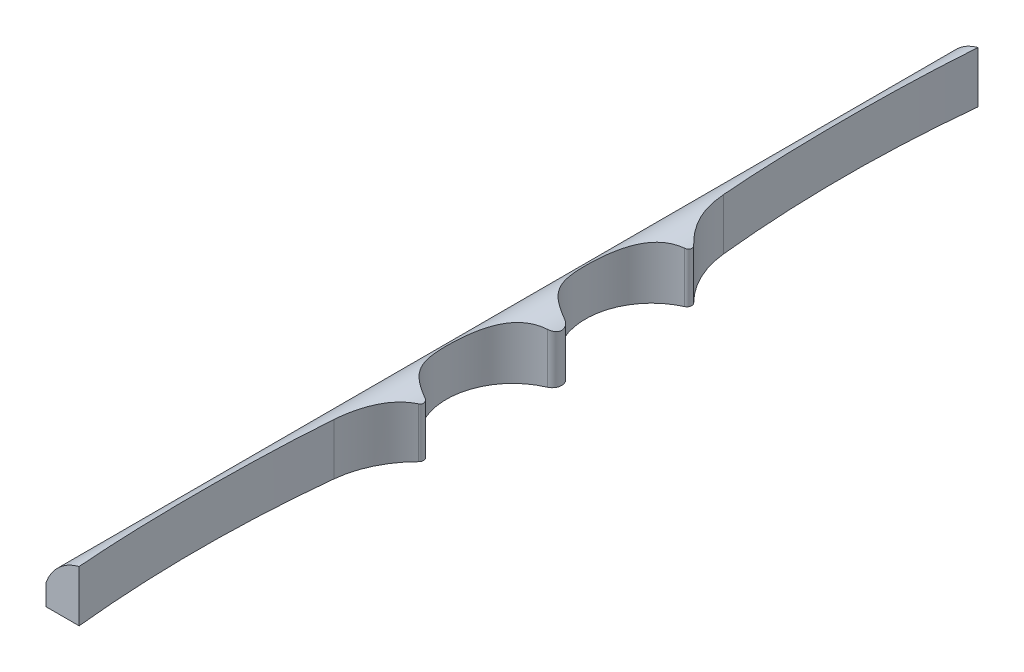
ISO-10303-21;
HEADER;
FILE_DESCRIPTION(('STEP AP214'),'2;1');
FILE_NAME('part.step','',(''),(''),'','','');
FILE_SCHEMA(('AUTOMOTIVE_DESIGN { 1 0 10303 214 1 1 1 1 }'));
ENDSEC;
DATA;
#1=APPLICATION_CONTEXT('core data for automotive mechanical design processes');
#2=APPLICATION_PROTOCOL_DEFINITION('international standard','automotive_design',2000,#1);
#3=PRODUCT_CONTEXT('',#1,'mechanical');
#4=PRODUCT('Part','Part','',(#3));
#5=PRODUCT_RELATED_PRODUCT_CATEGORY('part','',(#4));
#6=PRODUCT_DEFINITION_FORMATION('','',#4);
#7=PRODUCT_DEFINITION_CONTEXT('part definition',#1,'design');
#8=PRODUCT_DEFINITION('design','',#6,#7);
#9=PRODUCT_DEFINITION_SHAPE('','',#8);
#10=(LENGTH_UNIT() NAMED_UNIT(*) SI_UNIT(.MILLI.,.METRE.));
#11=(NAMED_UNIT(*) PLANE_ANGLE_UNIT() SI_UNIT($,.RADIAN.));
#12=(NAMED_UNIT(*) SI_UNIT($,.STERADIAN.) SOLID_ANGLE_UNIT());
#13=UNCERTAINTY_MEASURE_WITH_UNIT(LENGTH_MEASURE(1.E-05),#10,'distance_accuracy_value','');
#14=(GEOMETRIC_REPRESENTATION_CONTEXT(3) GLOBAL_UNCERTAINTY_ASSIGNED_CONTEXT((#13)) GLOBAL_UNIT_ASSIGNED_CONTEXT((#10,
#11,#12)) REPRESENTATION_CONTEXT('',''));
#15=CARTESIAN_POINT('',(0.,0.,0.));
#16=DIRECTION('',(0.,0.,1.));
#17=DIRECTION('',(1.,0.,0.));
#18=AXIS2_PLACEMENT_3D('',#15,#16,#17);
#19=CARTESIAN_POINT('',(-40.,35.,490.));
#20=DIRECTION('',(1.,0.,0.));
#21=DIRECTION('',(0.,1.,0.));
#22=AXIS2_PLACEMENT_3D('',#19,#20,#21);
#23=PLANE('',#22);
#24=DIRECTION('',(0.,1.,0.));
#25=VECTOR('',#24,1.);
#26=CARTESIAN_POINT('',(-40.,-35.,475.));
#27=LINE('',#26,#25);
#28=CARTESIAN_POINT('',(-40.,-35.,475.));
#29=VERTEX_POINT('',#28);
#30=CARTESIAN_POINT('',(-40.0000000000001,-12.9999999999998,475.));
#31=VERTEX_POINT('',#30);
#32=EDGE_CURVE('E141',#29,#31,#27,.T.);
#33=ORIENTED_EDGE('',*,*,#32,.T.);
#34=DIRECTION('',(0.,0.,-1.));
#35=VECTOR('',#34,1.);
#36=CARTESIAN_POINT('',(-40.0000000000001,-12.9999999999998,475.));
#37=LINE('',#36,#35);
#38=CARTESIAN_POINT('',(-40.0000000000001,-12.9999999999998,-475.));
#39=VERTEX_POINT('',#38);
#40=EDGE_CURVE('E124',#31,#39,#37,.T.);
#41=ORIENTED_EDGE('',*,*,#40,.T.);
#42=DIRECTION('',(0.,1.,0.));
#43=VECTOR('',#42,1.);
#44=CARTESIAN_POINT('',(-40.,-35.,-475.));
#45=LINE('',#44,#43);
#46=CARTESIAN_POINT('',(-40.,-35.,-475.));
#47=VERTEX_POINT('',#46);
#48=EDGE_CURVE('E147',#47,#39,#45,.T.);
#49=ORIENTED_EDGE('',*,*,#48,.F.);
#50=DIRECTION('',(0.,0.,-1.));
#51=VECTOR('',#50,1.);
#52=CARTESIAN_POINT('',(-40.,-35.,490.));
#53=LINE('',#52,#51);
#54=EDGE_CURVE('E46',#29,#47,#53,.T.);
#55=ORIENTED_EDGE('',*,*,#54,.F.);
#56=EDGE_LOOP('',(#33,#41,#49,#55));
#57=FACE_BOUND('',#56,.T.);
#58=ADVANCED_FACE('F34',(#57),#23,.F.);
#59=CARTESIAN_POINT('',(-40.,-35.,490.));
#60=DIRECTION('',(0.,1.,0.));
#61=DIRECTION('',(0.,0.,1.));
#62=AXIS2_PLACEMENT_3D('',#59,#60,#61);
#63=PLANE('',#62);
#64=DIRECTION('',(1.,0.,0.));
#65=VECTOR('',#64,1.);
#66=CARTESIAN_POINT('',(-40.,-35.,-475.));
#67=LINE('',#66,#65);
#68=CARTESIAN_POINT('',(-5.00000000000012,-35.,-475.));
#69=VERTEX_POINT('',#68);
#70=EDGE_CURVE('E144',#47,#69,#67,.T.);
#71=ORIENTED_EDGE('',*,*,#70,.T.);
#72=CARTESIAN_POINT('',(1290.30701747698,-35.,-341.220593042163));
#73=DIRECTION('',(0.,1.,0.));
#74=DIRECTION('',(0.,0.,-1.));
#75=AXIS2_PLACEMENT_3D('',#72,#73,#74);
#76=CIRCLE('',#75,1302.19706621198);
#77=CARTESIAN_POINT('',(-4.84315200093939,-35.,-205.93113390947));
#78=VERTEX_POINT('',#77);
#79=EDGE_CURVE('E160',#69,#78,#76,.T.);
#80=ORIENTED_EDGE('',*,*,#79,.T.);
#81=CARTESIAN_POINT('',(94.6156935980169,-35.,-216.320456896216));
#82=DIRECTION('',(0.,1.,0.));
#83=DIRECTION('',(0.,0.,1.));
#84=AXIS2_PLACEMENT_3D('',#81,#82,#83);
#85=CIRCLE('',#84,99.9999999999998);
#86=CARTESIAN_POINT('',(24.2222778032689,-35.,-145.293933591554));
#87=VERTEX_POINT('',#86);
#88=EDGE_CURVE('E163',#78,#87,#85,.T.);
#89=ORIENTED_EDGE('',*,*,#88,.T.);
#90=CARTESIAN_POINT('',(20.7026070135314,-35.,-141.742607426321));
#91=DIRECTION('',(0.,-1.,0.));
#92=DIRECTION('',(0.,0.,-1.));
#93=AXIS2_PLACEMENT_3D('',#90,#91,#92);
#94=CIRCLE('',#93,5.00000000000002);
#95=CARTESIAN_POINT('',(22.7693613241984,-35.,-137.189748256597));
#96=VERTEX_POINT('',#95);
#97=EDGE_CURVE('E167',#87,#96,#94,.T.);
#98=ORIENTED_EDGE('',*,*,#97,.T.);
#99=CARTESIAN_POINT('',(51.703921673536,-35.,-73.4497198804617));
#100=DIRECTION('',(0.,1.,0.));
#101=DIRECTION('',(0.,0.,1.));
#102=AXIS2_PLACEMENT_3D('',#99,#100,#101);
#103=CIRCLE('',#102,70.);
#104=CARTESIAN_POINT('',(23.962990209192,-35.,-9.18121498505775));
#105=VERTEX_POINT('',#104);
#106=EDGE_CURVE('E178',#96,#105,#103,.T.);
#107=ORIENTED_EDGE('',*,*,#106,.T.);
#108=CARTESIAN_POINT('',(20.,-35.,0.));
#109=DIRECTION('',(0.,-1.,0.));
#110=DIRECTION('',(0.,0.,1.));
#111=AXIS2_PLACEMENT_3D('',#108,#109,#110);
#112=CIRCLE('',#111,10.);
#113=CARTESIAN_POINT('',(23.962990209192,-35.,9.18121498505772));
#114=VERTEX_POINT('',#113);
#115=EDGE_CURVE('E181',#105,#114,#112,.T.);
#116=ORIENTED_EDGE('',*,*,#115,.T.);
#117=CARTESIAN_POINT('',(51.703921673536,-35.,73.4497198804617));
#118=DIRECTION('',(0.,1.,0.));
#119=DIRECTION('',(0.,0.,-1.));
#120=AXIS2_PLACEMENT_3D('',#117,#118,#119);
#121=CIRCLE('',#120,70.);
#122=CARTESIAN_POINT('',(22.7693613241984,-35.,137.189748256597));
#123=VERTEX_POINT('',#122);
#124=EDGE_CURVE('E184',#114,#123,#121,.T.);
#125=ORIENTED_EDGE('',*,*,#124,.T.);
#126=CARTESIAN_POINT('',(20.7026070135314,-35.,141.742607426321));
#127=DIRECTION('',(0.,-1.,0.));
#128=DIRECTION('',(0.,0.,-1.));
#129=AXIS2_PLACEMENT_3D('',#126,#127,#128);
#130=CIRCLE('',#129,5.00000000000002);
#131=CARTESIAN_POINT('',(24.2222778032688,-35.,145.293933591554));
#132=VERTEX_POINT('',#131);
#133=EDGE_CURVE('E187',#123,#132,#130,.T.);
#134=ORIENTED_EDGE('',*,*,#133,.T.);
#135=CARTESIAN_POINT('',(94.6156935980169,-35.,216.320456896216));
#136=DIRECTION('',(0.,1.,0.));
#137=DIRECTION('',(0.,0.,-1.));
#138=AXIS2_PLACEMENT_3D('',#135,#136,#137);
#139=CIRCLE('',#138,99.9999999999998);
#140=CARTESIAN_POINT('',(-4.84315200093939,-35.,205.93113390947));
#141=VERTEX_POINT('',#140);
#142=EDGE_CURVE('E190',#132,#141,#139,.T.);
#143=ORIENTED_EDGE('',*,*,#142,.T.);
#144=CARTESIAN_POINT('',(1290.30701747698,-35.,341.220593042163));
#145=DIRECTION('',(0.,1.,0.));
#146=DIRECTION('',(0.,0.,1.));
#147=AXIS2_PLACEMENT_3D('',#144,#145,#146);
#148=CIRCLE('',#147,1302.19706621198);
#149=CARTESIAN_POINT('',(-4.99999999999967,-35.,475.));
#150=VERTEX_POINT('',#149);
#151=EDGE_CURVE('E193',#141,#150,#148,.T.);
#152=ORIENTED_EDGE('',*,*,#151,.T.);
#153=DIRECTION('',(-1.,0.,0.));
#154=VECTOR('',#153,1.);
#155=CARTESIAN_POINT('',(-40.,-35.,475.));
#156=LINE('',#155,#154);
#157=EDGE_CURVE('E145',#150,#29,#156,.T.);
#158=ORIENTED_EDGE('',*,*,#157,.T.);
#159=ORIENTED_EDGE('',*,*,#54,.T.);
#160=EDGE_LOOP('',(#71,#80,#89,#98,#107,#116,#125,#134,#143,#152,#158,#159));
#161=FACE_BOUND('',#160,.T.);
#162=ADVANCED_FACE('F158',(#161),#63,.F.);
#163=CARTESIAN_POINT('',(-40.,-35.,-475.));
#164=DIRECTION('',(0.,0.,1.));
#165=DIRECTION('',(1.,0.,0.));
#166=AXIS2_PLACEMENT_3D('',#163,#164,#165);
#167=PLANE('',#166);
#168=ORIENTED_EDGE('',*,*,#48,.T.);
#169=CARTESIAN_POINT('',(7.34260642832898,-29.0834578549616,-475.));
#170=DIRECTION('',(0.,0.,1.));
#171=DIRECTION('',(-1.,0.,0.));
#172=AXIS2_PLACEMENT_3D('',#169,#170,#171);
#173=CIRCLE('',#172,50.);
#174=CARTESIAN_POINT('',(-4.99999999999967,19.3692001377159,-475.));
#175=VERTEX_POINT('',#174);
#176=EDGE_CURVE('E130',#175,#39,#173,.T.);
#177=ORIENTED_EDGE('',*,*,#176,.F.);
#178=DIRECTION('',(0.,1.,0.));
#179=VECTOR('',#178,1.);
#180=CARTESIAN_POINT('',(-5.00000000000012,-35.,-475.));
#181=LINE('',#180,#179);
#182=EDGE_CURVE('E149',#69,#175,#181,.T.);
#183=ORIENTED_EDGE('',*,*,#182,.F.);
#184=ORIENTED_EDGE('',*,*,#70,.F.);
#185=EDGE_LOOP('',(#168,#177,#183,#184));
#186=FACE_BOUND('',#185,.T.);
#187=ADVANCED_FACE('F154',(#186),#167,.F.);
#188=CARTESIAN_POINT('',(-40.,-35.,475.));
#189=DIRECTION('',(0.,0.,-1.));
#190=DIRECTION('',(-1.,0.,0.));
#191=AXIS2_PLACEMENT_3D('',#188,#189,#190);
#192=PLANE('',#191);
#193=DIRECTION('',(0.,1.,0.));
#194=VECTOR('',#193,1.);
#195=CARTESIAN_POINT('',(-4.99999999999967,-35.,475.));
#196=LINE('',#195,#194);
#197=CARTESIAN_POINT('',(-4.99999999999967,19.3692001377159,475.));
#198=VERTEX_POINT('',#197);
#199=EDGE_CURVE('E142',#150,#198,#196,.T.);
#200=ORIENTED_EDGE('',*,*,#199,.T.);
#201=CARTESIAN_POINT('',(7.34260642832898,-29.0834578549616,475.));
#202=DIRECTION('',(0.,0.,1.));
#203=DIRECTION('',(-1.,0.,0.));
#204=AXIS2_PLACEMENT_3D('',#201,#202,#203);
#205=CIRCLE('',#204,50.);
#206=EDGE_CURVE('E127',#198,#31,#205,.T.);
#207=ORIENTED_EDGE('',*,*,#206,.T.);
#208=ORIENTED_EDGE('',*,*,#32,.F.);
#209=ORIENTED_EDGE('',*,*,#157,.F.);
#210=EDGE_LOOP('',(#200,#207,#208,#209));
#211=FACE_BOUND('',#210,.T.);
#212=ADVANCED_FACE('F139',(#211),#192,.F.);
#213=CARTESIAN_POINT('',(1290.30701747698,-35.,-341.220593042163));
#214=DIRECTION('',(0.,1.,0.));
#215=DIRECTION('',(0.,0.,1.));
#216=AXIS2_PLACEMENT_3D('',#213,#214,#215);
#217=CYLINDRICAL_SURFACE('',#216,1302.19706621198);
#218=ORIENTED_EDGE('',*,*,#182,.T.);
#219=CARTESIAN_POINT('',(-4.99999999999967,19.369200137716,-475.));
#220=CARTESIAN_POINT('',(-5.42881179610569,19.2599278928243,-470.848069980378));
#221=CARTESIAN_POINT('',(-5.83765826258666,19.1497553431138,-466.694101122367));
#222=CARTESIAN_POINT('',(-6.61539129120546,18.9304832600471,-458.382392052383));
#223=CARTESIAN_POINT('',(-6.98427781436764,18.8213837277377,-454.224651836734));
#224=CARTESIAN_POINT('',(-7.68206251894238,18.6071310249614,-445.905694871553));
#225=CARTESIAN_POINT('',(-8.01096051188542,18.5019778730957,-441.744478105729));
#226=CARTESIAN_POINT('',(-8.62873659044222,18.2982060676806,-433.418913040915));
#227=CARTESIAN_POINT('',(-8.91761466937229,18.1995874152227,-429.254564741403));
#228=CARTESIAN_POINT('',(-9.45472845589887,18.0114497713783,-420.932272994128));
#229=CARTESIAN_POINT('',(-9.70305243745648,17.9219111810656,-416.774335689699));
#230=CARTESIAN_POINT('',(-10.1597996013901,17.753760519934,-408.456055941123));
#231=CARTESIAN_POINT('',(-10.3682228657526,17.6751484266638,-404.295713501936));
#232=CARTESIAN_POINT('',(-10.7451454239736,17.5306384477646,-395.972957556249));
#233=CARTESIAN_POINT('',(-10.9136443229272,17.4647406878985,-391.810544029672));
#234=CARTESIAN_POINT('',(-11.2106942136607,17.3471418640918,-383.484054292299));
#235=CARTESIAN_POINT('',(-11.3392448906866,17.295440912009,-379.319978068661));
#236=CARTESIAN_POINT('',(-11.5396528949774,17.214166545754,-371.632214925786));
#237=CARTESIAN_POINT('',(-11.6171932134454,17.18241129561,-368.108697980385));
#238=CARTESIAN_POINT('',(-11.7436638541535,17.1303819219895,-361.061052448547));
#239=CARTESIAN_POINT('',(-11.7925940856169,17.1101078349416,-357.536923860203));
#240=CARTESIAN_POINT('',(-11.8618390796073,17.0813628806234,-350.488299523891));
#241=CARTESIAN_POINT('',(-11.8821535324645,17.0728921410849,-346.963803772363));
#242=CARTESIAN_POINT('',(-11.8941637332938,17.0678879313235,-339.91475419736));
#243=CARTESIAN_POINT('',(-11.8858594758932,17.0713544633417,-336.390200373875));
#244=CARTESIAN_POINT('',(-11.840631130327,17.0901709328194,-329.340990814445));
#245=CARTESIAN_POINT('',(-11.8037044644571,17.1055219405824,-325.816335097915));
#246=CARTESIAN_POINT('',(-11.7012322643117,17.1478657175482,-318.767509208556));
#247=CARTESIAN_POINT('',(-11.6356867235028,17.1748584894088,-315.24333903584));
#248=CARTESIAN_POINT('',(-11.4759842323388,17.2400575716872,-308.195767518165));
#249=CARTESIAN_POINT('',(-11.3818274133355,17.2782638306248,-304.67236616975));
#250=CARTESIAN_POINT('',(-11.1649120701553,17.3652817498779,-297.626574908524));
#251=CARTESIAN_POINT('',(-11.0421535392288,17.4140934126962,-294.104184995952));
#252=CARTESIAN_POINT('',(-10.7675364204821,17.5217409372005,-287.047548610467));
#253=CARTESIAN_POINT('',(-10.615571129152,17.5806134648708,-283.513306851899));
#254=CARTESIAN_POINT('',(-10.2828519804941,17.7072986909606,-276.446339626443));
#255=CARTESIAN_POINT('',(-10.1020981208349,17.7751113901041,-272.913614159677));
#256=CARTESIAN_POINT('',(-9.71181668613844,17.9185620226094,-265.849894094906));
#257=CARTESIAN_POINT('',(-9.50228895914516,17.9941999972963,-262.31889950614));
#258=CARTESIAN_POINT('',(-9.05447746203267,18.15203721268,-255.258881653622));
#259=CARTESIAN_POINT('',(-8.81619369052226,18.2342364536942,-251.729858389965));
#260=CARTESIAN_POINT('',(-8.31091998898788,18.4037837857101,-244.674445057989));
#261=CARTESIAN_POINT('',(-8.04393372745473,18.4911312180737,-241.14805471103));
#262=CARTESIAN_POINT('',(-7.48124800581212,18.6694520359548,-234.097657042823));
#263=CARTESIAN_POINT('',(-7.18554853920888,18.7604254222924,-230.573649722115));
#264=CARTESIAN_POINT('',(-6.56545877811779,18.944351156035,-223.528261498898));
#265=CARTESIAN_POINT('',(-6.24106888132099,19.0373034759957,-220.006880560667));
#266=CARTESIAN_POINT('',(-5.56361301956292,19.223398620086,-212.966885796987));
#267=CARTESIAN_POINT('',(-5.21054707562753,19.3165414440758,-209.448271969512));
#268=CARTESIAN_POINT('',(-4.84315200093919,19.4088847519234,-205.931133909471));
#269=B_SPLINE_CURVE_WITH_KNOTS('',3,(#219,#220,#221,#222,#223,#224,#225,#226,#227,#228,#229,
#230,#231,#232,#233,#234,#235,#236,#237,#238,#239,#240,#241,#242,#243,#244,#245,#246,#247,#248,
#249,#250,#251,#252,#253,#254,#255,#256,#257,#258,#259,#260,#261,#262,#263,#264,#265,#266,#267,
#268),.UNSPECIFIED.,.F.,.F.,(4,2,2,2,2,2,2,2,2,2,2,2,2,2,2,2,2,2,2,2,2,2,2,2,4),(0.,
12.5262885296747,25.0525892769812,37.5789490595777,50.1053109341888,62.6040324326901,
75.1027282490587,87.6015476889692,100.100465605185,110.673875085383,121.247318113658,
131.820875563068,142.394434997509,152.968946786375,163.543460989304,174.117926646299,
184.692394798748,195.306256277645,205.920118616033,216.534037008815,227.147955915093,
237.760519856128,248.37308619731,258.985505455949,269.597916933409),.UNSPECIFIED.);
#270=CARTESIAN_POINT('',(-4.84315200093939,19.4088847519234,-205.93113390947));
#271=VERTEX_POINT('',#270);
#272=EDGE_CURVE('E224',#175,#271,#269,.T.);
#273=ORIENTED_EDGE('',*,*,#272,.T.);
#274=DIRECTION('',(0.,1.,0.));
#275=VECTOR('',#274,1.);
#276=CARTESIAN_POINT('',(-4.84315200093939,-35.,-205.93113390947));
#277=LINE('',#276,#275);
#278=EDGE_CURVE('E196',#78,#271,#277,.T.);
#279=ORIENTED_EDGE('',*,*,#278,.F.);
#280=ORIENTED_EDGE('',*,*,#79,.F.);
#281=EDGE_LOOP('',(#218,#273,#279,#280));
#282=FACE_BOUND('',#281,.T.);
#283=ADVANCED_FACE('F223',(#282),#217,.F.);
#284=CARTESIAN_POINT('',(1290.30701747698,-35.,341.220593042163));
#285=DIRECTION('',(0.,1.,0.));
#286=DIRECTION('',(0.,0.,1.));
#287=AXIS2_PLACEMENT_3D('',#284,#285,#286);
#288=CYLINDRICAL_SURFACE('',#287,1302.19706621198);
#289=DIRECTION('',(0.,1.,0.));
#290=VECTOR('',#289,1.);
#291=CARTESIAN_POINT('',(-4.84315200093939,-35.,205.93113390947));
#292=LINE('',#291,#290);
#293=CARTESIAN_POINT('',(-4.84315200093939,19.4088847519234,205.93113390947));
#294=VERTEX_POINT('',#293);
#295=EDGE_CURVE('E199',#141,#294,#292,.T.);
#296=ORIENTED_EDGE('',*,*,#295,.T.);
#297=CARTESIAN_POINT('',(-4.84315200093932,19.4088847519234,205.93113390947));
#298=CARTESIAN_POINT('',(-5.27680391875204,19.2998728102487,210.082559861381));
#299=CARTESIAN_POINT('',(-5.69049238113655,19.1897685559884,214.236042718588));
#300=CARTESIAN_POINT('',(-6.47791310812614,18.9702755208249,222.546816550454));
#301=CARTESIAN_POINT('',(-6.85164533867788,18.8608867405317,226.704107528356));
#302=CARTESIAN_POINT('',(-7.55912496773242,18.6457245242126,235.022201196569));
#303=CARTESIAN_POINT('',(-7.89287220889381,18.5399511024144,239.183003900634));
#304=CARTESIAN_POINT('',(-8.52035060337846,18.3346362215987,247.507781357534));
#305=CARTESIAN_POINT('',(-8.81408174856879,18.2350947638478,251.671756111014));
#306=CARTESIAN_POINT('',(-9.36089489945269,18.0448420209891,259.993347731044));
#307=CARTESIAN_POINT('',(-9.61406513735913,17.9541117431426,264.150958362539));
#308=CARTESIAN_POINT('',(-10.0805082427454,17.7833403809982,272.46862977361));
#309=CARTESIAN_POINT('',(-10.2937811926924,17.703299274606,276.628690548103));
#310=CARTESIAN_POINT('',(-10.680406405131,17.5557298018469,284.950933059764));
#311=CARTESIAN_POINT('',(-10.8537582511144,17.4882015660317,289.113114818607));
#312=CARTESIAN_POINT('',(-11.1605167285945,17.3671789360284,297.439191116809));
#313=CARTESIAN_POINT('',(-11.2939230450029,17.3136846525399,301.603085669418));
#314=CARTESIAN_POINT('',(-11.5032966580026,17.2289872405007,309.290577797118));
#315=CARTESIAN_POINT('',(-11.584946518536,17.1956196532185,312.813997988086));
#316=CARTESIAN_POINT('',(-11.7196370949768,17.1403043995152,319.861488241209));
#317=CARTESIAN_POINT('',(-11.7726777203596,17.1183567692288,323.385558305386));
#318=CARTESIAN_POINT('',(-11.8501439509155,17.0862301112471,330.434104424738));
#319=CARTESIAN_POINT('',(-11.8745692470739,17.0760512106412,333.958580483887));
#320=CARTESIAN_POINT('',(-11.8948010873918,17.0676231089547,341.007629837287));
#321=CARTESIAN_POINT('',(-11.8906076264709,17.0693739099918,344.532203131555));
#322=CARTESIAN_POINT('',(-11.8536007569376,17.084778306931,351.581486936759));
#323=CARTESIAN_POINT('',(-11.820784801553,17.0984329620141,355.106197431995));
#324=CARTESIAN_POINT('',(-11.7265331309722,17.1374304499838,362.155171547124));
#325=CARTESIAN_POINT('',(-11.6650974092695,17.1627732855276,365.679435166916));
#326=CARTESIAN_POINT('',(-11.513613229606,17.2247452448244,372.727231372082));
#327=CARTESIAN_POINT('',(-11.4235649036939,17.2613743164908,376.250763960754));
#328=CARTESIAN_POINT('',(-11.2148648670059,17.3453360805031,383.296854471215));
#329=CARTESIAN_POINT('',(-11.0962131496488,17.3926687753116,386.81941239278));
#330=CARTESIAN_POINT('',(-10.8298234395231,17.4974755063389,393.876408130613));
#331=CARTESIAN_POINT('',(-10.6819788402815,17.5549866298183,397.410841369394));
#332=CARTESIAN_POINT('',(-10.3574990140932,17.6790959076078,404.478225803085));
#333=CARTESIAN_POINT('',(-10.1808637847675,17.7456940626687,408.011176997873));
#334=CARTESIAN_POINT('',(-9.79881735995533,17.88688448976,415.075381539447));
#335=CARTESIAN_POINT('',(-9.59340600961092,17.9614768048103,418.606634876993));
#336=CARTESIAN_POINT('',(-9.15382487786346,18.1174121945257,425.667201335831));
#337=CARTESIAN_POINT('',(-8.91965509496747,18.1987552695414,429.196514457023));
#338=CARTESIAN_POINT('',(-8.42260560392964,18.366799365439,436.252548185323));
#339=CARTESIAN_POINT('',(-8.15972947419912,18.453499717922,439.779269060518));
#340=CARTESIAN_POINT('',(-7.60526134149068,18.6307530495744,446.830356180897));
#341=CARTESIAN_POINT('',(-7.31366933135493,18.7213060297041,450.354722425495));
#342=CARTESIAN_POINT('',(-6.70179184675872,18.9046345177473,457.400854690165));
#343=CARTESIAN_POINT('',(-6.38150677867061,18.9974099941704,460.922620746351));
#344=CARTESIAN_POINT('',(-5.7122579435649,19.1834109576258,467.96341211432));
#345=CARTESIAN_POINT('',(-5.36329419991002,19.2766364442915,471.482437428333));
#346=CARTESIAN_POINT('',(-4.99999999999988,19.3692001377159,475.));
#347=B_SPLINE_CURVE_WITH_KNOTS('',3,(#297,#298,#299,#300,#301,#302,#303,#304,#305,#306,#307,
#308,#309,#310,#311,#312,#313,#314,#315,#316,#317,#318,#319,#320,#321,#322,#323,#324,#325,#326,
#327,#328,#329,#330,#331,#332,#333,#334,#335,#336,#337,#338,#339,#340,#341,#342,#343,#344,#345,
#346),.UNSPECIFIED.,.F.,.F.,(4,2,2,2,2,2,2,2,2,2,2,2,2,2,2,2,2,2,2,2,2,2,2,2,4),(0.,
12.5262637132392,25.0525381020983,37.5788617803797,50.105188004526,62.6038844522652,
75.1025550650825,87.6013560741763,100.100255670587,110.673698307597,121.247174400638,
131.820764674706,142.39435682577,152.968889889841,163.543425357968,174.117912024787,
184.69240112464,195.306245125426,205.920090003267,216.533992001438,227.147894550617,
237.760475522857,248.373059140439,258.985492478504,269.597917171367),.UNSPECIFIED.);
#348=EDGE_CURVE('E165',#294,#198,#347,.T.);
#349=ORIENTED_EDGE('',*,*,#348,.T.);
#350=ORIENTED_EDGE('',*,*,#199,.F.);
#351=ORIENTED_EDGE('',*,*,#151,.F.);
#352=EDGE_LOOP('',(#296,#349,#350,#351));
#353=FACE_BOUND('',#352,.T.);
#354=ADVANCED_FACE('F251',(#353),#288,.F.);
#355=CARTESIAN_POINT('',(94.6156935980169,-35.,216.320456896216));
#356=DIRECTION('',(0.,1.,0.));
#357=DIRECTION('',(0.,0.,1.));
#358=AXIS2_PLACEMENT_3D('',#355,#356,#357);
#359=CYLINDRICAL_SURFACE('',#358,99.9999999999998);
#360=DIRECTION('',(0.,1.,0.));
#361=VECTOR('',#360,1.);
#362=CARTESIAN_POINT('',(24.2222778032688,-35.,145.293933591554));
#363=LINE('',#362,#361);
#364=CARTESIAN_POINT('',(24.2222778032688,17.9811434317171,145.293933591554));
#365=VERTEX_POINT('',#364);
#366=EDGE_CURVE('E202',#132,#365,#363,.T.);
#367=ORIENTED_EDGE('',*,*,#366,.T.);
#368=CARTESIAN_POINT('',(24.222277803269,17.981143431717,145.293933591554));
#369=CARTESIAN_POINT('',(23.8542505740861,18.1131352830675,145.658677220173));
#370=CARTESIAN_POINT('',(23.4880815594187,18.2395901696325,146.027256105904));
#371=CARTESIAN_POINT('',(22.7598392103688,18.4818256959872,146.771860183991));
#372=CARTESIAN_POINT('',(22.3977656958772,18.5976068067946,147.147885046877));
#373=CARTESIAN_POINT('',(21.318470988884,18.9294750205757,148.286564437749));
#374=CARTESIAN_POINT('',(20.6079068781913,19.1301826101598,149.060089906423));
#375=CARTESIAN_POINT('',(19.2087884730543,19.4934414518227,150.63252617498));
#376=CARTESIAN_POINT('',(18.5201931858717,19.6560678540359,151.431383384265));
#377=CARTESIAN_POINT('',(17.165676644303,19.947013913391,153.054257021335));
#378=CARTESIAN_POINT('',(16.4997571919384,20.0753308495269,153.878275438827));
#379=CARTESIAN_POINT('',(15.1961933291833,20.3003067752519,155.545000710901));
#380=CARTESIAN_POINT('',(14.5584110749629,20.3971395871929,156.387576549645));
#381=CARTESIAN_POINT('',(13.308600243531,20.5633384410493,158.094384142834));
#382=CARTESIAN_POINT('',(12.6965747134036,20.6327012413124,158.958618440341));
#383=CARTESIAN_POINT('',(11.4992586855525,20.7470961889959,160.707669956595));
#384=CARTESIAN_POINT('',(10.913983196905,20.7921148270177,161.592498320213));
#385=CARTESIAN_POINT('',(9.7715894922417,20.8607855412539,163.380832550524));
#386=CARTESIAN_POINT('',(9.21446925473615,20.8844391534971,164.284337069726));
#387=CARTESIAN_POINT('',(7.97806287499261,20.917321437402,166.362853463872));
#388=CARTESIAN_POINT('',(7.30794647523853,20.9207008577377,167.543425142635));
#389=CARTESIAN_POINT('',(6.01638898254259,20.90312306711,169.930744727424));
#390=CARTESIAN_POINT('',(5.39495074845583,20.8821644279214,171.137494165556));
#391=CARTESIAN_POINT('',(4.2017681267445,20.8213720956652,173.575119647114));
#392=CARTESIAN_POINT('',(3.63003338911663,20.7815347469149,174.806000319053));
#393=CARTESIAN_POINT('',(2.53732181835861,20.6881196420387,177.289521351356));
#394=CARTESIAN_POINT('',(2.01634377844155,20.6345422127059,178.542161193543));
#395=CARTESIAN_POINT('',(1.02542547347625,20.5183800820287,181.068442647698));
#396=CARTESIAN_POINT('',(0.555534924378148,20.4557867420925,182.342103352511));
#397=CARTESIAN_POINT('',(-0.331963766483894,20.3260768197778,184.907331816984));
#398=CARTESIAN_POINT('',(-0.749570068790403,20.2589600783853,186.198900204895));
#399=CARTESIAN_POINT('',(-1.53167271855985,20.1243113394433,188.79730388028));
#400=CARTESIAN_POINT('',(-1.89619469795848,20.0567795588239,190.104131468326));
#401=CARTESIAN_POINT('',(-2.57177225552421,19.924945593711,192.731559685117));
#402=CARTESIAN_POINT('',(-2.88283434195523,19.8606430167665,194.052158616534));
#403=CARTESIAN_POINT('',(-3.35366904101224,19.7594130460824,196.250596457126));
#404=CARTESIAN_POINT('',(-3.52876017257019,19.7206550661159,197.125101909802));
#405=CARTESIAN_POINT('',(-3.85548242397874,19.6467264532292,198.878479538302));
#406=CARTESIAN_POINT('',(-4.00711792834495,19.611555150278,199.757350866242));
#407=CARTESIAN_POINT('',(-4.28649423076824,19.5455939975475,201.516786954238));
#408=CARTESIAN_POINT('',(-4.41429388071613,19.514793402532,202.397341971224));
#409=CARTESIAN_POINT('',(-4.64638865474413,19.4580482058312,204.161871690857));
#410=CARTESIAN_POINT('',(-4.7506792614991,19.4321045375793,205.04584701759));
#411=CARTESIAN_POINT('',(-4.84315200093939,19.4088847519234,205.93113390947));
#412=B_SPLINE_CURVE_WITH_KNOTS('',3,(#368,#369,#370,#371,#372,#373,#374,#375,#376,#377,#378,
#379,#380,#381,#382,#383,#384,#385,#386,#387,#388,#389,#390,#391,#392,#393,#394,#395,#396,#397,
#398,#399,#400,#401,#402,#403,#404,#405,#406,#407,#408,#409,#410,#411),.UNSPECIFIED.,.F.,.F.,(4,
2,2,2,2,2,2,2,2,2,2,2,2,2,2,2,2,2,2,2,2,4),(0.,1.60399933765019,3.20792785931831,
6.41461587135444,9.61492138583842,12.8154806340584,15.9980572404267,19.1810093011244,
22.3657258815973,25.5502134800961,29.6212667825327,33.6925589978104,37.7646399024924,
41.8366239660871,45.9125358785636,49.9885911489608,54.0626717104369,58.1362559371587,
60.8140710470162,63.491384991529,66.1619983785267,68.8331244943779),.UNSPECIFIED.);
#413=EDGE_CURVE('E169',#365,#294,#412,.T.);
#414=ORIENTED_EDGE('',*,*,#413,.T.);
#415=ORIENTED_EDGE('',*,*,#295,.F.);
#416=ORIENTED_EDGE('',*,*,#142,.F.);
#417=EDGE_LOOP('',(#367,#414,#415,#416));
#418=FACE_BOUND('',#417,.T.);
#419=ADVANCED_FACE('F279',(#418),#359,.F.);
#420=CARTESIAN_POINT('',(20.7026070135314,-35.,141.742607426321));
#421=DIRECTION('',(0.,1.,0.));
#422=DIRECTION('',(0.,0.,1.));
#423=AXIS2_PLACEMENT_3D('',#420,#421,#422);
#424=CYLINDRICAL_SURFACE('',#423,5.00000000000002);
#425=DIRECTION('',(0.,1.,0.));
#426=VECTOR('',#425,1.);
#427=CARTESIAN_POINT('',(22.7693613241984,-35.,137.189748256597));
#428=LINE('',#427,#426);
#429=CARTESIAN_POINT('',(22.7693613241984,18.4771900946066,137.189748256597));
#430=VERTEX_POINT('',#429);
#431=EDGE_CURVE('E205',#123,#430,#428,.T.);
#432=ORIENTED_EDGE('',*,*,#431,.T.);
#433=CARTESIAN_POINT('',(22.7693613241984,18.4771900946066,137.189748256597));
#434=CARTESIAN_POINT('',(22.8993194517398,18.4350413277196,137.248732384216));
#435=CARTESIAN_POINT('',(23.0268040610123,18.3930974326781,137.313323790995));
#436=CARTESIAN_POINT('',(23.2760047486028,18.3100433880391,137.45331518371));
#437=CARTESIAN_POINT('',(23.3977199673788,18.268933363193,137.528716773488));
#438=CARTESIAN_POINT('',(23.6347536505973,18.1879044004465,137.690062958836));
#439=CARTESIAN_POINT('',(23.7500590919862,18.1479879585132,137.776027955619));
#440=CARTESIAN_POINT('',(23.9731759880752,18.069889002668,137.957889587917));
#441=CARTESIAN_POINT('',(24.0809878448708,18.031706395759,138.053785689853));
#442=CARTESIAN_POINT('',(24.2884419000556,17.9574904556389,138.255100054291));
#443=CARTESIAN_POINT('',(24.3880727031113,17.921460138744,138.360531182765));
#444=CARTESIAN_POINT('',(24.5782165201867,17.8520723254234,138.580209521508));
#445=CARTESIAN_POINT('',(24.6687263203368,17.8187157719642,138.694459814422));
#446=CARTESIAN_POINT('',(24.8396915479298,17.7552048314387,138.930884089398));
#447=CARTESIAN_POINT('',(24.9201583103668,17.7250468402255,139.053048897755));
#448=CARTESIAN_POINT('',(25.0703875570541,17.6683573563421,139.30458590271));
#449=CARTESIAN_POINT('',(25.1401508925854,17.6418255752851,139.433957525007));
#450=CARTESIAN_POINT('',(25.2656261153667,17.5938352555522,139.693516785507));
#451=CARTESIAN_POINT('',(25.3217981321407,17.5722128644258,139.823451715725));
#452=CARTESIAN_POINT('',(25.4230623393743,17.5330634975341,140.088108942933));
#453=CARTESIAN_POINT('',(25.4681592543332,17.515534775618,140.222829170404));
#454=CARTESIAN_POINT('',(25.5468261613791,17.4848593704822,140.496107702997));
#455=CARTESIAN_POINT('',(25.5803942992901,17.4717133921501,140.634666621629));
#456=CARTESIAN_POINT('',(25.6356143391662,17.4500434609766,140.914493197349));
#457=CARTESIAN_POINT('',(25.6572668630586,17.4415192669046,141.055760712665));
#458=CARTESIAN_POINT('',(25.6874322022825,17.4296328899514,141.330947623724));
#459=CARTESIAN_POINT('',(25.6966818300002,17.4259813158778,141.46477429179));
#460=CARTESIAN_POINT('',(25.7043954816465,17.4229365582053,141.73283458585));
#461=CARTESIAN_POINT('',(25.7028558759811,17.4235448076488,141.867068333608));
#462=CARTESIAN_POINT('',(25.6890034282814,17.4290111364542,142.134785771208));
#463=CARTESIAN_POINT('',(25.6766989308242,17.433865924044,142.26826996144));
#464=CARTESIAN_POINT('',(25.6414496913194,17.4477434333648,142.533655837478));
#465=CARTESIAN_POINT('',(25.6185010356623,17.4567676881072,142.6655569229));
#466=CARTESIAN_POINT('',(25.5628434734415,17.478584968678,142.923768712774));
#467=CARTESIAN_POINT('',(25.5303709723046,17.4912866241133,143.050138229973));
#468=CARTESIAN_POINT('',(25.4557837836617,17.5203446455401,143.299614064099));
#469=CARTESIAN_POINT('',(25.4136655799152,17.5367023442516,143.422719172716));
#470=CARTESIAN_POINT('',(25.3201568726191,17.5728406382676,143.664865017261));
#471=CARTESIAN_POINT('',(25.2687648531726,17.5926217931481,143.783905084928));
#472=CARTESIAN_POINT('',(25.1571545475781,17.635333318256,144.017196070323));
#473=CARTESIAN_POINT('',(25.0969333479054,17.6582647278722,144.131445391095));
#474=CARTESIAN_POINT('',(24.920682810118,17.7249335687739,144.436625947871));
#475=CARTESIAN_POINT('',(24.7961808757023,17.7715700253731,144.622160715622));
#476=CARTESIAN_POINT('',(24.592848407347,17.8466429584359,144.885591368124));
#477=CARTESIAN_POINT('',(24.5223667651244,17.872498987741,144.970864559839));
#478=CARTESIAN_POINT('',(24.376170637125,17.9257300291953,145.136291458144));
#479=CARTESIAN_POINT('',(24.3004564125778,17.9531049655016,145.216445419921));
#480=CARTESIAN_POINT('',(24.2222778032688,17.9811434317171,145.293933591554));
#481=B_SPLINE_CURVE_WITH_KNOTS('',3,(#433,#434,#435,#436,#437,#438,#439,#440,#441,#442,#443,
#444,#445,#446,#447,#448,#449,#450,#451,#452,#453,#454,#455,#456,#457,#458,#459,#460,#461,#462,
#463,#464,#465,#466,#467,#468,#469,#470,#471,#472,#473,#474,#475,#476,#477,#478,#479,#480),
.UNSPECIFIED.,.F.,.F.,(4,2,2,2,2,2,2,2,2,2,2,2,2,2,2,2,2,2,2,2,2,2,2,4),(0.,0.446315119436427,
0.8926965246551,1.33995399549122,1.78718744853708,2.23503364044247,2.68303708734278,
3.13053023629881,3.57798777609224,4.00703005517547,4.43588899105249,4.86481686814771,
5.29372235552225,5.69581464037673,6.09804219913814,6.49995824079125,6.9020221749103,
7.29484682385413,7.68781490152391,8.08084727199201,8.47400963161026,9.15630708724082,
9.49694482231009,9.83756556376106),.UNSPECIFIED.);
#482=EDGE_CURVE('E229',#430,#365,#481,.T.);
#483=ORIENTED_EDGE('',*,*,#482,.T.);
#484=ORIENTED_EDGE('',*,*,#366,.F.);
#485=ORIENTED_EDGE('',*,*,#133,.F.);
#486=EDGE_LOOP('',(#432,#483,#484,#485));
#487=FACE_BOUND('',#486,.T.);
#488=ADVANCED_FACE('F282',(#487),#424,.T.);
#489=CARTESIAN_POINT('',(51.703921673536,-35.,73.4497198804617));
#490=DIRECTION('',(0.,1.,0.));
#491=DIRECTION('',(0.,0.,1.));
#492=AXIS2_PLACEMENT_3D('',#489,#490,#491);
#493=CYLINDRICAL_SURFACE('',#492,70.);
#494=DIRECTION('',(0.,1.,0.));
#495=VECTOR('',#494,1.);
#496=CARTESIAN_POINT('',(23.962990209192,-35.,9.18121498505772));
#497=LINE('',#496,#495);
#498=CARTESIAN_POINT('',(23.962990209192,18.0733321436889,9.18121498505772));
#499=VERTEX_POINT('',#498);
#500=EDGE_CURVE('E208',#114,#499,#497,.T.);
#501=ORIENTED_EDGE('',*,*,#500,.T.);
#502=CARTESIAN_POINT('',(23.962990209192,18.0733321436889,9.18121498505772));
#503=CARTESIAN_POINT('',(23.351150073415,18.288999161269,9.44528049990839));
#504=CARTESIAN_POINT('',(22.7391519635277,18.4912874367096,9.71983741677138));
#505=CARTESIAN_POINT('',(21.5167891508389,18.8696568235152,10.2896797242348));
#506=CARTESIAN_POINT('',(20.9064242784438,19.0457407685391,10.5849628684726));
#507=CARTESIAN_POINT('',(19.6898203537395,19.3721168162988,11.1957210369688));
#508=CARTESIAN_POINT('',(19.0835774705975,19.522437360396,11.5111732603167));
#509=CARTESIAN_POINT('',(17.8762705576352,19.798290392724,12.1621981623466));
#510=CARTESIAN_POINT('',(17.2752066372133,19.9238223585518,12.4977712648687));
#511=CARTESIAN_POINT('',(16.0855665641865,20.149902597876,13.1852999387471));
#512=CARTESIAN_POINT('',(15.4969260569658,20.2506761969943,13.5370702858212));
#513=CARTESIAN_POINT('',(14.3277393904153,20.429749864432,14.2594059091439));
#514=CARTESIAN_POINT('',(13.7471941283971,20.5080474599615,14.6299732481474));
#515=CARTESIAN_POINT('',(12.5955160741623,20.6432262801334,15.3893345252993));
#516=CARTESIAN_POINT('',(12.0243843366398,20.7001051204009,15.7781304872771));
#517=CARTESIAN_POINT('',(10.8927648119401,20.7935793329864,16.5732924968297));
#518=CARTESIAN_POINT('',(10.3322781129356,20.8301726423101,16.9796603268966));
#519=CARTESIAN_POINT('',(8.67319972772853,20.9110581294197,18.2205828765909));
#520=CARTESIAN_POINT('',(7.59184308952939,20.9270362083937,19.0803492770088));
#521=CARTESIAN_POINT('',(5.48283460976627,20.8930781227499,20.8615326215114));
#522=CARTESIAN_POINT('',(4.4551793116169,20.8431462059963,21.7829455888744));
#523=CARTESIAN_POINT('',(2.45574812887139,20.6872825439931,23.6850136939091));
#524=CARTESIAN_POINT('',(1.48412385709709,20.5812061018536,24.6658160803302));
#525=CARTESIAN_POINT('',(-0.396698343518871,20.3230656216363,26.6798058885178));
#526=CARTESIAN_POINT('',(-1.30588729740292,20.1709949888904,27.7130008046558));
#527=CARTESIAN_POINT('',(-3.43403035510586,19.7580117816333,30.2797130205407));
#528=CARTESIAN_POINT('',(-4.61926595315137,19.478360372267,31.8383091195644));
#529=CARTESIAN_POINT('',(-6.85172284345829,18.8733911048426,35.0432955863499));
#530=CARTESIAN_POINT('',(-7.89889707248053,18.5480577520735,36.6897156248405));
#531=CARTESIAN_POINT('',(-9.85219032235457,17.8782949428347,40.0633521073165));
#532=CARTESIAN_POINT('',(-10.7581215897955,17.533840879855,41.7906721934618));
#533=CARTESIAN_POINT('',(-12.4233342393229,16.8525545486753,45.3162150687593));
#534=CARTESIAN_POINT('',(-13.1826276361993,16.515721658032,47.114432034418));
#535=CARTESIAN_POINT('',(-14.2114967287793,16.0337862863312,49.8672943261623));
#536=CARTESIAN_POINT('',(-14.537477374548,15.8762877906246,50.7990445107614));
#537=CARTESIAN_POINT('',(-15.1502246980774,15.5728911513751,52.6771780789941));
#538=CARTESIAN_POINT('',(-15.4369956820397,15.426991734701,53.6235598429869));
#539=CARTESIAN_POINT('',(-15.9706819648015,15.1497990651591,55.5296840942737));
#540=CARTESIAN_POINT('',(-16.217594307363,15.0185068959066,56.4894275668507));
#541=CARTESIAN_POINT('',(-16.6708632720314,14.7733511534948,58.4206646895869));
#542=CARTESIAN_POINT('',(-16.8772200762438,14.6594875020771,59.392158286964));
#543=CARTESIAN_POINT('',(-17.248266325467,14.4519769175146,61.3427403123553));
#544=CARTESIAN_POINT('',(-17.4130563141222,14.3582812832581,62.321804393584));
#545=CARTESIAN_POINT('',(-17.7010357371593,14.1929051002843,64.2878987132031));
#546=CARTESIAN_POINT('',(-17.8242250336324,14.1212246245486,65.2749289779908));
#547=CARTESIAN_POINT('',(-18.0285044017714,14.0015832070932,67.2546510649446));
#548=CARTESIAN_POINT('',(-18.1095997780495,13.9536192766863,68.2473421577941));
#549=CARTESIAN_POINT('',(-18.2293708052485,13.8825620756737,70.2361605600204));
#550=CARTESIAN_POINT('',(-18.268047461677,13.8594682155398,71.2322877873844));
#551=CARTESIAN_POINT('',(-18.3012672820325,13.8396362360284,73.1367197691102));
#552=CARTESIAN_POINT('',(-18.2994357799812,13.8407331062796,74.044941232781));
#553=CARTESIAN_POINT('',(-18.2604489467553,13.8639994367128,75.8603424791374));
#554=CARTESIAN_POINT('',(-18.2232943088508,13.8861684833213,76.7675222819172));
#555=CARTESIAN_POINT('',(-18.1137981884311,13.9511270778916,78.5789824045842));
#556=CARTESIAN_POINT('',(-18.0414576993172,13.9939160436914,79.4832628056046));
#557=CARTESIAN_POINT('',(-17.8618436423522,14.0992530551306,81.2871886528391));
#558=CARTESIAN_POINT('',(-17.7545698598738,14.1618012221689,82.1868340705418));
#559=CARTESIAN_POINT('',(-17.5052924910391,14.3055110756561,83.9809060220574));
#560=CARTESIAN_POINT('',(-17.3632472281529,14.3866950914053,84.875324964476));
#561=CARTESIAN_POINT('',(-17.0449266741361,14.5660734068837,86.6563170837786));
#562=CARTESIAN_POINT('',(-16.8686513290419,14.6642677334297,87.5428902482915));
#563=CARTESIAN_POINT('',(-16.4823538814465,14.8758388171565,89.3067972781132));
#564=CARTESIAN_POINT('',(-16.2723327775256,14.9892151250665,90.1841314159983));
#565=CARTESIAN_POINT('',(-15.8190474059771,15.2291074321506,91.9283801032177));
#566=CARTESIAN_POINT('',(-15.5757800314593,15.3556246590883,92.7952936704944));
#567=CARTESIAN_POINT('',(-14.813776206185,15.7430183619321,95.3226117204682));
#568=CARTESIAN_POINT('',(-14.2500732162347,16.0189580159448,96.9673911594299));
#569=CARTESIAN_POINT('',(-13.0037464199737,16.5947274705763,100.206593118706));
#570=CARTESIAN_POINT('',(-12.3211241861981,16.8945569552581,101.801016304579));
#571=CARTESIAN_POINT('',(-10.8395930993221,17.5003205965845,104.934862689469));
#572=CARTESIAN_POINT('',(-10.0406179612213,17.8062581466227,106.474253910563));
#573=CARTESIAN_POINT('',(-8.32946257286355,18.405571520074,109.491366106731));
#574=CARTESIAN_POINT('',(-7.41728470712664,18.6989476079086,110.969088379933));
#575=CARTESIAN_POINT('',(-5.51318802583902,19.2453998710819,113.81102431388));
#576=CARTESIAN_POINT('',(-4.52470411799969,19.4994572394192,115.177349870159));
#577=CARTESIAN_POINT('',(-2.44710764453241,19.9603307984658,117.840216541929));
#578=CARTESIAN_POINT('',(-1.35799572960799,20.1671472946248,119.136758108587));
#579=CARTESIAN_POINT('',(0.345444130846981,20.4278369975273,121.020941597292));
#580=CARTESIAN_POINT('',(0.923885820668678,20.5063897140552,121.637940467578));
#581=CARTESIAN_POINT('',(2.10382454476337,20.6448834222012,122.851605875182));
#582=CARTESIAN_POINT('',(2.70531898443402,20.7048265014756,123.448274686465));
#583=CARTESIAN_POINT('',(3.93052316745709,20.80376948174,124.620230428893));
#584=CARTESIAN_POINT('',(4.55423410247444,20.8427682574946,125.195516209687));
#585=CARTESIAN_POINT('',(5.82274254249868,20.8974684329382,126.323509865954));
#586=CARTESIAN_POINT('',(6.46753934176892,20.9131706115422,126.876218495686));
#587=CARTESIAN_POINT('',(7.72015692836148,20.9186921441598,127.910990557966));
#588=CARTESIAN_POINT('',(8.32634009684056,20.9106364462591,128.395025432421));
#589=CARTESIAN_POINT('',(9.55398043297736,20.8713912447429,129.342326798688));
#590=CARTESIAN_POINT('',(10.1754369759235,20.8402026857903,129.805594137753));
#591=CARTESIAN_POINT('',(11.4320579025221,20.7530039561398,130.710318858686));
#592=CARTESIAN_POINT('',(12.0672180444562,20.6970013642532,131.151782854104));
#593=CARTESIAN_POINT('',(13.3497463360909,20.5585628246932,132.012108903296));
#594=CARTESIAN_POINT('',(13.9971129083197,20.4761302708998,132.430973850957));
#595=CARTESIAN_POINT('',(15.3102190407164,20.2821464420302,133.250258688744));
#596=CARTESIAN_POINT('',(15.9760861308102,20.1702549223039,133.650394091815));
#597=CARTESIAN_POINT('',(17.3164204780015,19.9164227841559,134.425939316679));
#598=CARTESIAN_POINT('',(17.9908874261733,19.7744832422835,134.801350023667));
#599=CARTESIAN_POINT('',(19.3472873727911,19.4590287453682,135.52741728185));
#600=CARTESIAN_POINT('',(20.0292310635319,19.2854608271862,135.878030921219));
#601=CARTESIAN_POINT('',(21.3970291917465,18.9058944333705,136.553410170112));
#602=CARTESIAN_POINT('',(22.0828842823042,18.6998903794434,136.878171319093));
#603=CARTESIAN_POINT('',(22.7693613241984,18.4771900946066,137.189748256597));
#604=B_SPLINE_CURVE_WITH_KNOTS('',3,(#502,#503,#504,#505,#506,#507,#508,#509,#510,#511,#512,
#513,#514,#515,#516,#517,#518,#519,#520,#521,#522,#523,#524,#525,#526,#527,#528,#529,#530,#531,
#532,#533,#534,#535,#536,#537,#538,#539,#540,#541,#542,#543,#544,#545,#546,#547,#548,#549,#550,
#551,#552,#553,#554,#555,#556,#557,#558,#559,#560,#561,#562,#563,#564,#565,#566,#567,#568,#569,
#570,#571,#572,#573,#574,#575,#576,#577,#578,#579,#580,#581,#582,#583,#584,#585,#586,#587,#588,
#589,#590,#591,#592,#593,#594,#595,#596,#597,#598,#599,#600,#601,#602,#603),.UNSPECIFIED.,.F.,
.F.,(4,2,2,2,2,2,2,2,2,2,2,2,2,2,2,2,2,2,2,2,2,2,2,2,2,2,2,2,2,2,2,2,2,2,2,2,2,2,2,2,2,2,2,2,2,
2,2,2,2,2,4),(0.,2.10102339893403,4.20181943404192,6.30028115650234,8.39878709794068,
10.4774213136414,12.5562841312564,14.635378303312,16.7146838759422,20.8547763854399,
24.9946020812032,29.1451493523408,33.2962920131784,39.2218985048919,45.1495197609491,
51.0849545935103,57.0199028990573,60.0179708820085,63.0157093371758,66.0136700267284,
69.0116172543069,72.0022418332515,74.9928763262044,77.9831338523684,80.9733204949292,
83.6970745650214,86.420775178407,89.1443988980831,91.8680393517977,94.594960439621,
97.3218858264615,100.048730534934,102.775830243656,108.051652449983,113.327404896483,
118.60617472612,123.88483338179,128.996523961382,134.108181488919,136.655711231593,
139.202955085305,141.75033577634,144.297631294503,146.624193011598,148.950659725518,
151.276416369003,153.601874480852,155.955468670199,158.308978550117,160.666466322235,
163.024359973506),.UNSPECIFIED.);
#605=EDGE_CURVE('E225',#499,#430,#604,.T.);
#606=ORIENTED_EDGE('',*,*,#605,.T.);
#607=ORIENTED_EDGE('',*,*,#431,.F.);
#608=ORIENTED_EDGE('',*,*,#124,.F.);
#609=EDGE_LOOP('',(#501,#606,#607,#608));
#610=FACE_BOUND('',#609,.T.);
#611=ADVANCED_FACE('F286',(#610),#493,.F.);
#612=CARTESIAN_POINT('',(20.,-35.,0.));
#613=DIRECTION('',(0.,1.,0.));
#614=DIRECTION('',(0.,0.,1.));
#615=AXIS2_PLACEMENT_3D('',#612,#613,#614);
#616=CYLINDRICAL_SURFACE('',#615,10.);
#617=DIRECTION('',(0.,1.,0.));
#618=VECTOR('',#617,1.);
#619=CARTESIAN_POINT('',(23.962990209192,-35.,-9.18121498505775));
#620=LINE('',#619,#618);
#621=CARTESIAN_POINT('',(23.962990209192,18.0733321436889,-9.18121498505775));
#622=VERTEX_POINT('',#621);
#623=EDGE_CURVE('E211',#105,#622,#620,.T.);
#624=ORIENTED_EDGE('',*,*,#623,.T.);
#625=CARTESIAN_POINT('',(23.962990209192,18.0733321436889,-9.18121498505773));
#626=CARTESIAN_POINT('',(24.2306555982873,17.979012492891,-9.06569040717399));
#627=CARTESIAN_POINT('',(24.4930361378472,17.8839561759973,-8.93854040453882));
#628=CARTESIAN_POINT('',(25.0056587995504,17.6935757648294,-8.66187988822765));
#629=CARTESIAN_POINT('',(25.2558999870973,17.5982516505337,-8.51236765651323));
#630=CARTESIAN_POINT('',(25.7432923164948,17.4082993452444,-8.19145733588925));
#631=CARTESIAN_POINT('',(25.9804061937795,17.3136737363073,-8.02000110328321));
#632=CARTESIAN_POINT('',(26.4392442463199,17.1267116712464,-7.65648711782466));
#633=CARTESIAN_POINT('',(26.6609688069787,17.0343751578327,-7.4644298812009));
#634=CARTESIAN_POINT('',(27.0877371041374,16.8532772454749,-7.06048271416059));
#635=CARTESIAN_POINT('',(27.2927595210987,16.7645204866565,-6.84856815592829));
#636=CARTESIAN_POINT('',(27.6842099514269,16.592191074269,-6.40625683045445));
#637=CARTESIAN_POINT('',(27.8706387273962,16.5086182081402,-6.17586082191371));
#638=CARTESIAN_POINT('',(28.2231133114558,16.3482700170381,-5.69810841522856));
#639=CARTESIAN_POINT('',(28.3891787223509,16.2714881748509,-5.45076869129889));
#640=CARTESIAN_POINT('',(28.6994876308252,16.1261980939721,-4.94045271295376));
#641=CARTESIAN_POINT('',(28.843732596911,16.0576892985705,-4.67747751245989));
#642=CARTESIAN_POINT('',(29.1023746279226,15.9335619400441,-4.15074125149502));
#643=CARTESIAN_POINT('',(29.217877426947,15.8774803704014,-3.8876326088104));
#644=CARTESIAN_POINT('',(29.4263161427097,15.7754681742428,-3.35074056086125));
#645=CARTESIAN_POINT('',(29.5192552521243,15.7295361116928,-3.07695867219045));
#646=CARTESIAN_POINT('',(29.6813521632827,15.6489536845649,-2.5209583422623));
#647=CARTESIAN_POINT('',(29.7505214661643,15.6142978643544,-2.2387440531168));
#648=CARTESIAN_POINT('',(29.8641651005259,15.5571454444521,-1.66818196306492));
#649=CARTESIAN_POINT('',(29.9086420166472,15.5346475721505,-1.37983480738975));
#650=CARTESIAN_POINT('',(29.9690206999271,15.504055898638,-0.829100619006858));
#651=CARTESIAN_POINT('',(29.9873628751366,15.494732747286,-0.567046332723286));
#652=CARTESIAN_POINT('',(30.0033568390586,15.4866047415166,-0.0421542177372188));
#653=CARTESIAN_POINT('',(30.001010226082,15.4877990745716,0.220683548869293));
#654=CARTESIAN_POINT('',(29.9756602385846,15.500676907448,0.745047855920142));
#655=CARTESIAN_POINT('',(29.9526607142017,15.5123584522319,1.00657463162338));
#656=CARTESIAN_POINT('',(29.8862965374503,15.5459429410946,1.52636341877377));
#657=CARTESIAN_POINT('',(29.8429319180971,15.5678458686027,1.78462543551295));
#658=CARTESIAN_POINT('',(29.7385874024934,15.6202700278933,2.28529092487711));
#659=CARTESIAN_POINT('',(29.6784190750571,15.6503929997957,2.52790617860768));
#660=CARTESIAN_POINT('',(29.5404621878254,15.7190100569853,3.00694729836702));
#661=CARTESIAN_POINT('',(29.4626674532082,15.7575070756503,3.24337096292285));
#662=CARTESIAN_POINT('',(29.2902496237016,15.8421491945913,3.70847060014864));
#663=CARTESIAN_POINT('',(29.1956329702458,15.8882913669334,3.93714949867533));
#664=CARTESIAN_POINT('',(28.9903452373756,15.9874684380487,4.38572240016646));
#665=CARTESIAN_POINT('',(28.8796683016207,16.040505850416,4.60561316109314));
#666=CARTESIAN_POINT('',(28.63645124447,16.155809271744,5.04766345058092));
#667=CARTESIAN_POINT('',(28.5030272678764,16.2184280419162,5.26924462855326));
#668=CARTESIAN_POINT('',(28.2202613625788,16.3494356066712,5.70033227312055));
#669=CARTESIAN_POINT('',(28.0709125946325,16.4178268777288,5.90983349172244));
#670=CARTESIAN_POINT('',(27.7572915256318,16.5593974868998,6.31587525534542));
#671=CARTESIAN_POINT('',(27.5930087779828,16.6325801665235,6.51240655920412));
#672=CARTESIAN_POINT('',(27.2506525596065,16.7827022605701,6.89153756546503));
#673=CARTESIAN_POINT('',(27.0725778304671,16.8596420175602,7.07413599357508));
#674=CARTESIAN_POINT('',(26.6742790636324,17.0288004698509,7.45258296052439));
#675=CARTESIAN_POINT('',(26.4518586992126,17.1215011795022,7.6459111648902));
#676=CARTESIAN_POINT('',(25.9914372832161,17.3092459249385,8.01181488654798));
#677=CARTESIAN_POINT('',(25.7534335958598,17.4042903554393,8.18438687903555));
#678=CARTESIAN_POINT('',(25.2637037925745,17.5952646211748,8.50760772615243));
#679=CARTESIAN_POINT('',(25.0119920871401,17.6911934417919,8.65827901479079));
#680=CARTESIAN_POINT('',(24.4962984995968,17.8827744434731,8.93695926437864));
#681=CARTESIAN_POINT('',(24.2323192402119,17.9784266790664,9.06497304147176));
#682=CARTESIAN_POINT('',(23.962990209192,18.0733321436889,9.18121498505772));
#683=B_SPLINE_CURVE_WITH_KNOTS('',3,(#625,#626,#627,#628,#629,#630,#631,#632,#633,#634,#635,
#636,#637,#638,#639,#640,#641,#642,#643,#644,#645,#646,#647,#648,#649,#650,#651,#652,#653,#654,
#655,#656,#657,#658,#659,#660,#661,#662,#663,#664,#665,#666,#667,#668,#669,#670,#671,#672,#673,
#674,#675,#676,#677,#678,#679,#680,#681,#682),.UNSPECIFIED.,.F.,.F.,(4,2,2,2,2,2,2,2,2,2,2,2,2,
2,2,2,2,2,2,2,2,2,2,2,2,2,2,2,4),(0.,0.918955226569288,1.83798109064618,2.75949450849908,
3.68098484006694,4.60363356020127,5.52624442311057,6.44796004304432,7.36961360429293,
8.24671722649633,9.12369666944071,10.0002511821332,10.8767139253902,11.6642944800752,
12.4518141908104,13.2391871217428,14.0265587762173,14.781037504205,15.5357809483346,
16.2902360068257,17.0449668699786,17.8424931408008,18.6403633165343,19.4387959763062,
20.2373015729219,21.1629623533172,22.0887801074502,23.0136427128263,23.9383084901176),.UNSPECIFIED.);
#684=EDGE_CURVE('E226',#622,#499,#683,.T.);
#685=ORIENTED_EDGE('',*,*,#684,.T.);
#686=ORIENTED_EDGE('',*,*,#500,.F.);
#687=ORIENTED_EDGE('',*,*,#115,.F.);
#688=EDGE_LOOP('',(#624,#685,#686,#687));
#689=FACE_BOUND('',#688,.T.);
#690=ADVANCED_FACE('F290',(#689),#616,.T.);
#691=CARTESIAN_POINT('',(51.703921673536,-35.,-73.4497198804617));
#692=DIRECTION('',(0.,1.,0.));
#693=DIRECTION('',(0.,0.,1.));
#694=AXIS2_PLACEMENT_3D('',#691,#692,#693);
#695=CYLINDRICAL_SURFACE('',#694,70.);
#696=DIRECTION('',(0.,1.,0.));
#697=VECTOR('',#696,1.);
#698=CARTESIAN_POINT('',(22.7693613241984,-35.,-137.189748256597));
#699=LINE('',#698,#697);
#700=CARTESIAN_POINT('',(22.7693613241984,18.4771900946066,-137.189748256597));
#701=VERTEX_POINT('',#700);
#702=EDGE_CURVE('E214',#96,#701,#699,.T.);
#703=ORIENTED_EDGE('',*,*,#702,.T.);
#704=CARTESIAN_POINT('',(22.7693613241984,18.4771900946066,-137.189748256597));
#705=CARTESIAN_POINT('',(22.1480568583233,18.6787399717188,-136.907740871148));
#706=CARTESIAN_POINT('',(21.5272530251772,18.8666254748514,-136.614943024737));
#707=CARTESIAN_POINT('',(20.2886287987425,19.2157538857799,-136.008123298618));
#708=CARTESIAN_POINT('',(19.6708080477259,19.3770000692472,-135.694104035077));
#709=CARTESIAN_POINT('',(18.4407088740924,19.6734092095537,-135.04551400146));
#710=CARTESIAN_POINT('',(17.8284247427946,19.8086029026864,-134.710968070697));
#711=CARTESIAN_POINT('',(16.6103877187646,20.0540447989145,-134.021442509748));
#712=CARTESIAN_POINT('',(16.0046349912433,20.1642923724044,-133.666462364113));
#713=CARTESIAN_POINT('',(14.8067284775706,20.3599632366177,-132.939915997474));
#714=CARTESIAN_POINT('',(14.2145012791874,20.4456017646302,-132.568528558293));
#715=CARTESIAN_POINT('',(13.0394271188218,20.5944751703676,-131.806786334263));
#716=CARTESIAN_POINT('',(12.4565812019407,20.6577075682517,-131.416429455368));
#717=CARTESIAN_POINT('',(11.301535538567,20.7629382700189,-130.617371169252));
#718=CARTESIAN_POINT('',(10.7293371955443,20.8049337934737,-130.20866736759));
#719=CARTESIAN_POINT('',(9.59678009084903,20.8689247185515,-129.373631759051));
#720=CARTESIAN_POINT('',(9.03642253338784,20.8909180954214,-128.947298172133));
#721=CARTESIAN_POINT('',(7.37980403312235,20.9286870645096,-127.646917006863));
#722=CARTESIAN_POINT('',(6.30245826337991,20.9167293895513,-126.747657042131));
#723=CARTESIAN_POINT('',(4.20550287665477,20.8290696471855,-124.887697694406));
#724=CARTESIAN_POINT('',(3.18589000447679,20.753371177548,-123.927001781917));
#725=CARTESIAN_POINT('',(1.20669151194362,20.5486114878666,-121.947070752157));
#726=CARTESIAN_POINT('',(0.247236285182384,20.4194386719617,-120.927717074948));
#727=CARTESIAN_POINT('',(-1.60597331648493,20.1182132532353,-118.837021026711));
#728=CARTESIAN_POINT('',(-2.49972248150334,19.9461572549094,-117.765674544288));
#729=CARTESIAN_POINT('',(-4.37223185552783,19.5358548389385,-115.380084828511));
#730=CARTESIAN_POINT('',(-5.33779198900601,19.2912776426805,-114.05655912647));
#731=CARTESIAN_POINT('',(-7.17146175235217,18.7730956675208,-111.349100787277));
#732=CARTESIAN_POINT('',(-8.03956353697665,18.4994885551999,-109.965163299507));
#733=CARTESIAN_POINT('',(-9.67670662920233,17.9387959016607,-107.140751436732));
#734=CARTESIAN_POINT('',(-10.44565163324,17.6516976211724,-105.700223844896));
#735=CARTESIAN_POINT('',(-11.881314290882,17.0797107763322,-102.768345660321));
#736=CARTESIAN_POINT('',(-12.5480218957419,16.7948224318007,-101.276990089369));
#737=CARTESIAN_POINT('',(-13.533439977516,16.3517293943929,-98.8477938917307));
#738=CARTESIAN_POINT('',(-13.8854892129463,16.1879877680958,-97.924342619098));
#739=CARTESIAN_POINT('',(-14.5506341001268,15.8700950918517,-96.0619154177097));
#740=CARTESIAN_POINT('',(-14.8637327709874,15.7159432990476,-95.1229406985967));
#741=CARTESIAN_POINT('',(-15.4503781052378,15.4203372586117,-93.2305574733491));
#742=CARTESIAN_POINT('',(-15.723917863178,15.2788852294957,-92.2771464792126));
#743=CARTESIAN_POINT('',(-16.2306990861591,15.0116819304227,-90.3574908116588));
#744=CARTESIAN_POINT('',(-16.4639410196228,14.8859304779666,-89.3912462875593));
#745=CARTESIAN_POINT('',(-16.889091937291,14.6530654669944,-87.4491806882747));
#746=CARTESIAN_POINT('',(-17.0810693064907,14.5459211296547,-86.4733783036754));
#747=CARTESIAN_POINT('',(-17.4235441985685,14.3524316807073,-84.5124527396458));
#748=CARTESIAN_POINT('',(-17.5740415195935,14.2660866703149,-83.5273295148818));
#749=CARTESIAN_POINT('',(-17.8329730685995,14.1162249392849,-81.5499873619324));
#750=CARTESIAN_POINT('',(-17.9414137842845,14.0527046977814,-80.557769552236));
#751=CARTESIAN_POINT('',(-18.115821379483,13.9500028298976,-78.5683572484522));
#752=CARTESIAN_POINT('',(-18.181789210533,13.9108206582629,-77.5711628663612));
#753=CARTESIAN_POINT('',(-18.2674851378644,13.859823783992,-75.6522569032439));
#754=CARTESIAN_POINT('',(-18.2904243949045,13.8461093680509,-74.7307375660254));
#755=CARTESIAN_POINT('',(-18.2998872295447,13.8404581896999,-72.8874542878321));
#756=CARTESIAN_POINT('',(-18.2864114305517,13.8485210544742,-71.9656903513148));
#757=CARTESIAN_POINT('',(-18.2230962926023,13.8862546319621,-70.1238773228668));
#758=CARTESIAN_POINT('',(-18.1732576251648,13.9159249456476,-69.203828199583));
#759=CARTESIAN_POINT('',(-18.0374025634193,13.9962515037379,-67.3673265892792));
#760=CARTESIAN_POINT('',(-17.9513859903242,14.0469078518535,-66.4508741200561));
#761=CARTESIAN_POINT('',(-17.7434084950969,14.1682050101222,-64.6227592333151));
#762=CARTESIAN_POINT('',(-17.6214230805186,14.2388594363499,-63.7111005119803));
#763=CARTESIAN_POINT('',(-17.3419343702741,14.3987147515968,-61.8948944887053));
#764=CARTESIAN_POINT('',(-17.1844309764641,14.4879156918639,-60.9903472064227));
#765=CARTESIAN_POINT('',(-16.8343728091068,14.683125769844,-59.1898736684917));
#766=CARTESIAN_POINT('',(-16.6418174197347,14.7891352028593,-58.2939475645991));
#767=CARTESIAN_POINT('',(-16.2221962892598,15.015939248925,-56.5121755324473));
#768=CARTESIAN_POINT('',(-15.995130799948,15.1367337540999,-55.6263295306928));
#769=CARTESIAN_POINT('',(-15.2900555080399,15.5039117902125,-53.0835056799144));
#770=CARTESIAN_POINT('',(-14.7683472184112,15.7665146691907,-51.4407595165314));
#771=CARTESIAN_POINT('',(-13.607286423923,16.3204531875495,-48.2028320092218));
#772=CARTESIAN_POINT('',(-12.9679411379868,16.6117870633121,-46.6076477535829));
#773=CARTESIAN_POINT('',(-11.5735472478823,17.2064368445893,-43.4677784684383));
#774=CARTESIAN_POINT('',(-10.8183146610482,17.5097712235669,-41.9231785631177));
#775=CARTESIAN_POINT('',(-9.19572688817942,18.1101018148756,-38.8926904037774));
#776=CARTESIAN_POINT('',(-8.32835991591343,18.4070973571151,-37.4068083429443));
#777=CARTESIAN_POINT('',(-6.34041305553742,19.0207876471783,-34.2730614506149));
#778=CARTESIAN_POINT('',(-5.20143168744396,19.3333642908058,-32.635936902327));
#779=CARTESIAN_POINT('',(-3.3871728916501,19.7556419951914,-30.252851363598));
#780=CARTESIAN_POINT('',(-2.76461062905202,19.8886656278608,-29.4703928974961));
#781=CARTESIAN_POINT('',(-1.48497621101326,20.1354231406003,-27.9311266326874));
#782=CARTESIAN_POINT('',(-0.827909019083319,20.2491597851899,-27.1743151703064));
#783=CARTESIAN_POINT('',(0.516657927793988,20.4530606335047,-25.6913568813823));
#784=CARTESIAN_POINT('',(1.20400292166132,20.543331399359,-24.9650844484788));
#785=CARTESIAN_POINT('',(2.61059991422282,20.6971461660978,-23.541335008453));
#786=CARTESIAN_POINT('',(3.32984686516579,20.7606943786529,-22.8438534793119));
#787=CARTESIAN_POINT('',(4.79856873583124,20.8572004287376,-21.4796112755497));
#788=CARTESIAN_POINT('',(5.54803569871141,20.8901662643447,-20.8128426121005));
#789=CARTESIAN_POINT('',(7.07535056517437,20.9216601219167,-19.5118236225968));
#790=CARTESIAN_POINT('',(7.85319558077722,20.9201916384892,-18.877570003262));
#791=CARTESIAN_POINT('',(9.23614469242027,20.8841865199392,-17.7985539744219));
#792=CARTESIAN_POINT('',(9.83557154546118,20.8580471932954,-17.3462057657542));
#793=CARTESIAN_POINT('',(11.0477095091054,20.7827720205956,-16.4616931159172));
#794=CARTESIAN_POINT('',(11.6604198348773,20.7336375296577,-16.0295274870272));
#795=CARTESIAN_POINT('',(12.8974957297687,20.6109020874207,-15.1863400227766));
#796=CARTESIAN_POINT('',(13.52185683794,20.5373103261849,-14.7753103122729));
#797=CARTESIAN_POINT('',(14.7807702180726,20.3642655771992,-13.9750436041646));
#798=CARTESIAN_POINT('',(15.4153210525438,20.2648162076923,-13.5858035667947));
#799=CARTESIAN_POINT('',(16.7009401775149,20.0373425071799,-12.8250043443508));
#800=CARTESIAN_POINT('',(17.3521158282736,19.908974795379,-12.4537288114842));
#801=CARTESIAN_POINT('',(18.6610997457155,19.6232205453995,-11.7348143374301));
#802=CARTESIAN_POINT('',(19.3189078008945,19.4658349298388,-11.3871746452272));
#803=CARTESIAN_POINT('',(20.6400457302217,19.1207404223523,-10.7154767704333));
#804=CARTESIAN_POINT('',(21.3033828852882,18.9329822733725,-10.391458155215));
#805=CARTESIAN_POINT('',(22.6322031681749,18.5265401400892,-9.7678908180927));
#806=CARTESIAN_POINT('',(23.2976865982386,18.307851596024,-9.46834571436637));
#807=CARTESIAN_POINT('',(23.962990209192,18.0733321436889,-9.18121498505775));
#808=B_SPLINE_CURVE_WITH_KNOTS('',3,(#704,#705,#706,#707,#708,#709,#710,#711,#712,#713,#714,
#715,#716,#717,#718,#719,#720,#721,#722,#723,#724,#725,#726,#727,#728,#729,#730,#731,#732,#733,
#734,#735,#736,#737,#738,#739,#740,#741,#742,#743,#744,#745,#746,#747,#748,#749,#750,#751,#752,
#753,#754,#755,#756,#757,#758,#759,#760,#761,#762,#763,#764,#765,#766,#767,#768,#769,#770,#771,
#772,#773,#774,#775,#776,#777,#778,#779,#780,#781,#782,#783,#784,#785,#786,#787,#788,#789,#790,
#791,#792,#793,#794,#795,#796,#797,#798,#799,#800,#801,#802,#803,#804,#805,#806,#807),
.UNSPECIFIED.,.F.,.F.,(4,2,2,2,2,2,2,2,2,2,2,2,2,2,2,2,2,2,2,2,2,2,2,2,2,2,2,2,2,2,2,2,2,2,2,2,
2,2,2,2,2,2,2,2,2,2,2,2,2,2,2,4),(0.,2.13411105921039,4.26795950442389,6.39927484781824,
8.53064397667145,10.642760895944,12.755111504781,14.8677386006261,16.9805795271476,
21.1860647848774,25.3913126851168,29.6053811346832,33.8197833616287,38.7846110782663,
43.7498381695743,48.7198518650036,53.6903537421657,56.694813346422,59.6990399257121,
62.7037902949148,65.7085057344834,68.7082025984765,71.7079140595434,74.7071625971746,
77.7063439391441,80.471104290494,83.2358173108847,86.0004792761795,88.7651549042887,
91.5317174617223,94.29828766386,97.0649064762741,99.8315051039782,105.05645718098,
110.281088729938,115.514102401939,120.747666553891,126.795043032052,129.820327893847,
132.845178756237,135.856043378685,138.866433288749,141.876035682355,144.88533264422,
147.138878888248,149.392292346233,151.644860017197,153.897112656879,156.177668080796,
158.458151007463,160.742370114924,163.026926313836),.UNSPECIFIED.);
#809=EDGE_CURVE('E231',#701,#622,#808,.T.);
#810=ORIENTED_EDGE('',*,*,#809,.T.);
#811=ORIENTED_EDGE('',*,*,#623,.F.);
#812=ORIENTED_EDGE('',*,*,#106,.F.);
#813=EDGE_LOOP('',(#703,#810,#811,#812));
#814=FACE_BOUND('',#813,.T.);
#815=ADVANCED_FACE('F294',(#814),#695,.F.);
#816=CARTESIAN_POINT('',(20.7026070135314,-35.,-141.742607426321));
#817=DIRECTION('',(0.,1.,0.));
#818=DIRECTION('',(0.,0.,1.));
#819=AXIS2_PLACEMENT_3D('',#816,#817,#818);
#820=CYLINDRICAL_SURFACE('',#819,5.00000000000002);
#821=DIRECTION('',(0.,1.,0.));
#822=VECTOR('',#821,1.);
#823=CARTESIAN_POINT('',(24.2222778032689,-35.,-145.293933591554));
#824=LINE('',#823,#822);
#825=CARTESIAN_POINT('',(24.2222778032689,17.981143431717,-145.293933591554));
#826=VERTEX_POINT('',#825);
#827=EDGE_CURVE('E217',#87,#826,#824,.T.);
#828=ORIENTED_EDGE('',*,*,#827,.T.);
#829=CARTESIAN_POINT('',(24.2222778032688,17.9811434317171,-145.293933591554));
#830=CARTESIAN_POINT('',(24.3186102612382,17.9465947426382,-145.198475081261));
#831=CARTESIAN_POINT('',(24.4112335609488,17.9130407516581,-145.098893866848));
#832=CARTESIAN_POINT('',(24.5884267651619,17.8483070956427,-144.892040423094));
#833=CARTESIAN_POINT('',(24.6729944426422,17.8171280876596,-144.784766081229));
#834=CARTESIAN_POINT('',(24.8335356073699,17.7574937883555,-144.562929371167));
#835=CARTESIAN_POINT('',(24.9094929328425,17.7290436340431,-144.448353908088));
#836=CARTESIAN_POINT('',(25.0519902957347,17.6753223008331,-144.212791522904));
#837=CARTESIAN_POINT('',(25.1185312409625,17.6500508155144,-144.091805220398));
#838=CARTESIAN_POINT('',(25.241730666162,17.6030039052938,-143.843928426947));
#839=CARTESIAN_POINT('',(25.2983688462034,17.5812356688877,-143.717026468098));
#840=CARTESIAN_POINT('',(25.401069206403,17.5415885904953,-143.45836450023));
#841=CARTESIAN_POINT('',(25.4471274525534,17.5237111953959,-143.326602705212));
#842=CARTESIAN_POINT('',(25.5281036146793,17.4921750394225,-143.059435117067));
#843=CARTESIAN_POINT('',(25.56303910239,17.4785096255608,-142.924035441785));
#844=CARTESIAN_POINT('',(25.6215035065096,17.4555893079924,-142.65037363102));
#845=CARTESIAN_POINT('',(25.6450284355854,17.4463359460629,-142.512110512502));
#846=CARTESIAN_POINT('',(25.6796210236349,17.4327137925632,-142.239926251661));
#847=CARTESIAN_POINT('',(25.6911860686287,17.4281500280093,-142.10607786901));
#848=CARTESIAN_POINT('',(25.7035058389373,17.4232880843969,-141.83775629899));
#849=CARTESIAN_POINT('',(25.7042566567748,17.4229914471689,-141.703282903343));
#850=CARTESIAN_POINT('',(25.6949300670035,17.4266726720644,-141.434786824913));
#851=CARTESIAN_POINT('',(25.6848538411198,17.4306500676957,-141.300764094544));
#852=CARTESIAN_POINT('',(25.653974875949,17.4428149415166,-141.034103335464));
#853=CARTESIAN_POINT('',(25.6331681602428,17.4510039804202,-140.901465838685));
#854=CARTESIAN_POINT('',(25.5816995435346,17.4712006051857,-140.641918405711));
#855=CARTESIAN_POINT('',(25.5512997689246,17.4831065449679,-140.514948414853));
#856=CARTESIAN_POINT('',(25.4807859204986,17.5106176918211,-140.264099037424));
#857=CARTESIAN_POINT('',(25.4406684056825,17.5262242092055,-140.140220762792));
#858=CARTESIAN_POINT('',(25.3511136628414,17.5608983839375,-139.896466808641));
#859=CARTESIAN_POINT('',(25.3016818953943,17.5799640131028,-139.776588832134));
#860=CARTESIAN_POINT('',(25.1938887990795,17.6213068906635,-139.541442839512));
#861=CARTESIAN_POINT('',(25.1355240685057,17.6435853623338,-139.426176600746));
#862=CARTESIAN_POINT('',(25.008432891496,17.6917848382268,-139.197517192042));
#863=CARTESIAN_POINT('',(24.9394447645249,17.717796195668,-139.084288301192));
#864=CARTESIAN_POINT('',(24.7930461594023,17.77257985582,-138.864098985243));
#865=CARTESIAN_POINT('',(24.7156327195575,17.8013531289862,-138.757140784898));
#866=CARTESIAN_POINT('',(24.4715500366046,17.8913153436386,-138.446496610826));
#867=CARTESIAN_POINT('',(24.2930154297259,17.956155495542,-138.252999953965));
#868=CARTESIAN_POINT('',(23.9035845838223,18.0946923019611,-137.892110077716));
#869=CARTESIAN_POINT('',(23.6918806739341,18.1685957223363,-137.72566976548));
#870=CARTESIAN_POINT('',(23.357553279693,18.2825150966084,-137.503599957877));
#871=CARTESIAN_POINT('',(23.2433441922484,18.3209895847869,-137.434188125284));
#872=CARTESIAN_POINT('',(23.0099426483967,18.39864119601,-137.30481669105));
#873=CARTESIAN_POINT('',(22.8907508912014,18.4378182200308,-137.24485576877));
#874=CARTESIAN_POINT('',(22.7693613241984,18.4771900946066,-137.189748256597));
#875=B_SPLINE_CURVE_WITH_KNOTS('',3,(#829,#830,#831,#832,#833,#834,#835,#836,#837,#838,#839,
#840,#841,#842,#843,#844,#845,#846,#847,#848,#849,#850,#851,#852,#853,#854,#855,#856,#857,#858,
#859,#860,#861,#862,#863,#864,#865,#866,#867,#868,#869,#870,#871,#872,#873,#874),.UNSPECIFIED.,
.F.,.F.,(4,2,2,2,2,2,2,2,2,2,2,2,2,2,2,2,2,2,2,2,2,2,4),(0.,0.419756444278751,0.839628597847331,
1.26027624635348,1.68088331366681,2.10234273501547,2.52395861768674,2.9449050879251,
3.36599854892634,3.76877404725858,4.17169507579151,4.57457213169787,4.97759858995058,
5.3704479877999,5.76343669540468,6.15619572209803,6.54910468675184,6.9539940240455,
7.35902615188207,8.16894827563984,9.00307473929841,9.4199432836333,9.8367535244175),.UNSPECIFIED.);
#876=EDGE_CURVE('E53',#826,#701,#875,.T.);
#877=ORIENTED_EDGE('',*,*,#876,.T.);
#878=ORIENTED_EDGE('',*,*,#702,.F.);
#879=ORIENTED_EDGE('',*,*,#97,.F.);
#880=EDGE_LOOP('',(#828,#877,#878,#879));
#881=FACE_BOUND('',#880,.T.);
#882=ADVANCED_FACE('F298',(#881),#820,.T.);
#883=CARTESIAN_POINT('',(94.6156935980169,-35.,-216.320456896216));
#884=DIRECTION('',(0.,1.,0.));
#885=DIRECTION('',(0.,0.,1.));
#886=AXIS2_PLACEMENT_3D('',#883,#884,#885);
#887=CYLINDRICAL_SURFACE('',#886,99.9999999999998);
#888=ORIENTED_EDGE('',*,*,#278,.T.);
#889=CARTESIAN_POINT('',(-4.84315200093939,19.4088847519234,-205.93113390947));
#890=CARTESIAN_POINT('',(-4.77071510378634,19.4270824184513,-205.237682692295));
#891=CARTESIAN_POINT('',(-4.69103244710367,19.4469393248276,-204.545054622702));
#892=CARTESIAN_POINT('',(-4.51721484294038,19.4897111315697,-203.161716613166));
#893=CARTESIAN_POINT('',(-4.42308005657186,19.5126259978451,-202.471006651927));
#894=CARTESIAN_POINT('',(-4.11907229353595,19.5855630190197,-200.402265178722));
#895=CARTESIAN_POINT('',(-3.887582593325,19.6397810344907,-199.02749460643));
#896=CARTESIAN_POINT('',(-3.367369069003,19.7567655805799,-196.288914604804));
#897=CARTESIAN_POINT('',(-3.0786319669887,19.8195340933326,-194.925107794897));
#898=CARTESIAN_POINT('',(-2.44446876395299,19.9503873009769,-192.21097732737));
#899=CARTESIAN_POINT('',(-2.09904220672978,20.0184720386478,-190.860653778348));
#900=CARTESIAN_POINT('',(-1.34862134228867,20.1568656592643,-188.163251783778));
#901=CARTESIAN_POINT('',(-0.943104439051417,20.2271893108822,-186.816319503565));
#902=CARTESIAN_POINT('',(-0.0755758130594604,20.3651362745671,-184.140626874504));
#903=CARTESIAN_POINT('',(0.386435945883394,20.4327595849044,-182.811866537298));
#904=CARTESIAN_POINT('',(1.36610238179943,20.5605280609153,-180.175036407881));
#905=CARTESIAN_POINT('',(1.88374286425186,20.6206751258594,-178.866961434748));
#906=CARTESIAN_POINT('',(2.97393584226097,20.7283353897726,-176.273399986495));
#907=CARTESIAN_POINT('',(3.54648565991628,20.7758492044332,-174.987912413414));
#908=CARTESIAN_POINT('',(4.61976085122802,20.8446041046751,-172.708891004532));
#909=CARTESIAN_POINT('',(5.11035967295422,20.8692656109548,-171.710678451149));
#910=CARTESIAN_POINT('',(6.12473568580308,20.9042844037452,-169.730892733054));
#911=CARTESIAN_POINT('',(6.64851493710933,20.9146408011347,-168.749320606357));
#912=CARTESIAN_POINT('',(7.72862407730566,20.9179689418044,-166.804045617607));
#913=CARTESIAN_POINT('',(8.28495805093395,20.9109384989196,-165.840345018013));
#914=CARTESIAN_POINT('',(9.42925980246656,20.8762609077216,-163.932397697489));
#915=CARTESIAN_POINT('',(10.0172243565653,20.8486158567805,-162.988149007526));
#916=CARTESIAN_POINT('',(11.220112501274,20.7695859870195,-161.126274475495));
#917=CARTESIAN_POINT('',(11.8348461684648,20.7183495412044,-160.208519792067));
#918=CARTESIAN_POINT('',(13.093481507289,20.5887444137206,-158.395099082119));
#919=CARTESIAN_POINT('',(13.7373844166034,20.5103745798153,-157.49943399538));
#920=CARTESIAN_POINT('',(15.0524689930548,20.3230082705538,-155.732459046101));
#921=CARTESIAN_POINT('',(15.7236339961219,20.2140302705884,-154.861134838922));
#922=CARTESIAN_POINT('',(17.0917288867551,19.9618100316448,-153.144200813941));
#923=CARTESIAN_POINT('',(17.7886543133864,19.8185737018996,-152.298586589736));
#924=CARTESIAN_POINT('',(18.9560991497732,19.5513879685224,-150.928360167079));
#925=CARTESIAN_POINT('',(19.4197706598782,19.4384560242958,-150.395728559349));
#926=CARTESIAN_POINT('',(20.3562396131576,19.1957227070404,-149.342625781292));
#927=CARTESIAN_POINT('',(20.829035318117,19.0659245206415,-148.822152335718));
#928=CARTESIAN_POINT('',(21.7841763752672,18.7881308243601,-147.792622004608));
#929=CARTESIAN_POINT('',(22.2665415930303,18.6400931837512,-147.283594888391));
#930=CARTESIAN_POINT('',(23.2389185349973,18.3250695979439,-146.27871562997));
#931=CARTESIAN_POINT('',(23.7289315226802,18.158080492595,-145.78286570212));
#932=CARTESIAN_POINT('',(24.2222778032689,17.981143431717,-145.293933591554));
#933=B_SPLINE_CURVE_WITH_KNOTS('',3,(#889,#890,#891,#892,#893,#894,#895,#896,#897,#898,#899,
#900,#901,#902,#903,#904,#905,#906,#907,#908,#909,#910,#911,#912,#913,#914,#915,#916,#917,#918,
#919,#920,#921,#922,#923,#924,#925,#926,#927,#928,#929,#930,#931,#932),.UNSPECIFIED.,.F.,.F.,(4,
2,2,2,2,2,2,2,2,2,2,2,2,2,2,2,2,2,2,2,2,4),(0.,2.09230063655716,4.18457794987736,
8.36874826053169,12.5538901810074,16.7390657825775,20.9630447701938,25.1870264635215,
29.4099328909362,33.6326334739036,36.9695633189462,40.3067005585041,43.6442574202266,
46.9814747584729,50.2979841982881,53.6146344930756,56.9292871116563,60.2433683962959,
62.388502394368,64.533231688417,66.6830113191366,68.8331499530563),.UNSPECIFIED.);
#934=EDGE_CURVE('E11',#271,#826,#933,.T.);
#935=ORIENTED_EDGE('',*,*,#934,.T.);
#936=ORIENTED_EDGE('',*,*,#827,.F.);
#937=ORIENTED_EDGE('',*,*,#88,.F.);
#938=EDGE_LOOP('',(#888,#935,#936,#937));
#939=FACE_BOUND('',#938,.T.);
#940=ADVANCED_FACE('F221',(#939),#887,.F.);
#941=CARTESIAN_POINT('',(7.34260642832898,-29.0834578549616,475.));
#942=DIRECTION('',(0.,0.,-1.));
#943=DIRECTION('',(-1.,0.,0.));
#944=AXIS2_PLACEMENT_3D('',#941,#942,#943);
#945=CYLINDRICAL_SURFACE('',#944,50.);
#946=ORIENTED_EDGE('',*,*,#413,.F.);
#947=ORIENTED_EDGE('',*,*,#482,.F.);
#948=ORIENTED_EDGE('',*,*,#605,.F.);
#949=ORIENTED_EDGE('',*,*,#684,.F.);
#950=ORIENTED_EDGE('',*,*,#809,.F.);
#951=ORIENTED_EDGE('',*,*,#876,.F.);
#952=ORIENTED_EDGE('',*,*,#934,.F.);
#953=ORIENTED_EDGE('',*,*,#272,.F.);
#954=ORIENTED_EDGE('',*,*,#176,.T.);
#955=ORIENTED_EDGE('',*,*,#40,.F.);
#956=ORIENTED_EDGE('',*,*,#206,.F.);
#957=ORIENTED_EDGE('',*,*,#348,.F.);
#958=EDGE_LOOP('',(#946,#947,#948,#949,#950,#951,#952,#953,#954,#955,#956,#957));
#959=FACE_BOUND('',#958,.T.);
#960=ADVANCED_FACE('F126',(#959),#945,.T.);
#961=CLOSED_SHELL('',(#58,#162,#187,#212,#283,#354,#419,#488,#611,#690,#815,#882,#940,#960));
#962=MANIFOLD_SOLID_BREP('B2',#961);
#963=ADVANCED_BREP_SHAPE_REPRESENTATION('',(#18,#962),#14);
#964=SHAPE_DEFINITION_REPRESENTATION(#9,#963);
ENDSEC;
END-ISO-10303-21;
